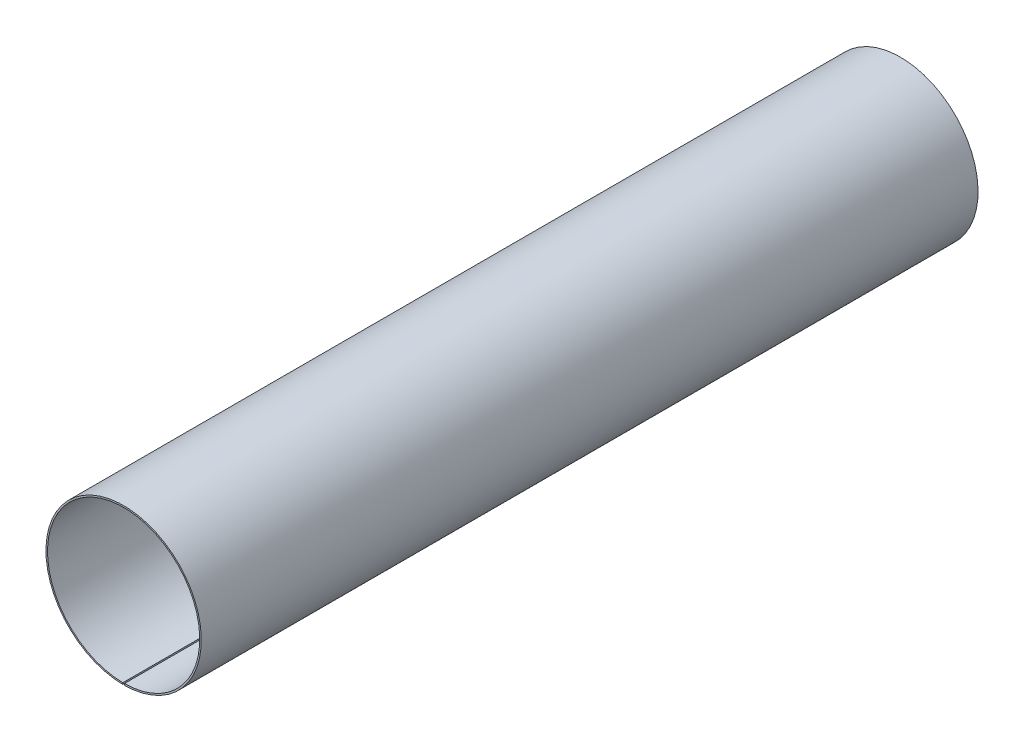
ISO-10303-21;
HEADER;
FILE_DESCRIPTION(('STEP AP214'),'2;1');
FILE_NAME('part.step','',(''),(''),'','','');
FILE_SCHEMA(('AUTOMOTIVE_DESIGN { 1 0 10303 214 1 1 1 1 }'));
ENDSEC;
DATA;
#1=APPLICATION_CONTEXT('core data for automotive mechanical design processes');
#2=APPLICATION_PROTOCOL_DEFINITION('international standard','automotive_design',2000,#1);
#3=PRODUCT_CONTEXT('',#1,'mechanical');
#4=PRODUCT('Part','Part','',(#3));
#5=PRODUCT_RELATED_PRODUCT_CATEGORY('part','',(#4));
#6=PRODUCT_DEFINITION_FORMATION('','',#4);
#7=PRODUCT_DEFINITION_CONTEXT('part definition',#1,'design');
#8=PRODUCT_DEFINITION('design','',#6,#7);
#9=PRODUCT_DEFINITION_SHAPE('','',#8);
#10=(LENGTH_UNIT() NAMED_UNIT(*) SI_UNIT(.MILLI.,.METRE.));
#11=(NAMED_UNIT(*) PLANE_ANGLE_UNIT() SI_UNIT($,.RADIAN.));
#12=(NAMED_UNIT(*) SI_UNIT($,.STERADIAN.) SOLID_ANGLE_UNIT());
#13=UNCERTAINTY_MEASURE_WITH_UNIT(LENGTH_MEASURE(1.E-05),#10,'distance_accuracy_value','');
#14=(GEOMETRIC_REPRESENTATION_CONTEXT(3) GLOBAL_UNCERTAINTY_ASSIGNED_CONTEXT((#13)) GLOBAL_UNIT_ASSIGNED_CONTEXT((#10,
#11,#12)) REPRESENTATION_CONTEXT('',''));
#15=CARTESIAN_POINT('',(0.,0.,0.));
#16=DIRECTION('',(0.,0.,1.));
#17=DIRECTION('',(1.,0.,0.));
#18=AXIS2_PLACEMENT_3D('',#15,#16,#17);
#19=CARTESIAN_POINT('',(0.490000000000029,-48.9975499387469,250.));
#20=DIRECTION('',(0.999949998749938,0.0100000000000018,0.));
#21=DIRECTION('',(0.,0.,1.));
#22=AXIS2_PLACEMENT_3D('',#19,#20,#21);
#23=PLANE('',#22);
#24=DIRECTION('',(0.0100000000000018,-0.999949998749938,0.));
#25=VECTOR('',#24,1.);
#26=CARTESIAN_POINT('',(0.49000000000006,-48.9975499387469,500.));
#27=LINE('',#26,#25);
#28=CARTESIAN_POINT('',(0.49000000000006,-48.9975499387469,500.));
#29=VERTEX_POINT('',#28);
#30=CARTESIAN_POINT('',(0.500000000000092,-49.9974999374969,500.));
#31=VERTEX_POINT('',#30);
#32=EDGE_CURVE('E12',#29,#31,#27,.T.);
#33=ORIENTED_EDGE('',*,*,#32,.F.);
#34=DIRECTION('',(0.,0.,1.));
#35=VECTOR('',#34,1.);
#36=CARTESIAN_POINT('',(0.489999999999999,-48.9975499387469,0.));
#37=LINE('',#36,#35);
#38=CARTESIAN_POINT('',(0.490000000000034,-48.9975499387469,0.));
#39=VERTEX_POINT('',#38);
#40=EDGE_CURVE('E85',#39,#29,#37,.T.);
#41=ORIENTED_EDGE('',*,*,#40,.F.);
#42=DIRECTION('',(0.0100000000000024,-0.999949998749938,0.));
#43=VECTOR('',#42,1.);
#44=CARTESIAN_POINT('',(0.490000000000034,-48.9975499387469,0.));
#45=LINE('',#44,#43);
#46=CARTESIAN_POINT('',(0.500000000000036,-49.9974999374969,0.));
#47=VERTEX_POINT('',#46);
#48=EDGE_CURVE('E47',#39,#47,#45,.T.);
#49=ORIENTED_EDGE('',*,*,#48,.T.);
#50=DIRECTION('',(0.,0.,-1.));
#51=VECTOR('',#50,1.);
#52=CARTESIAN_POINT('',(0.500000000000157,-49.9974999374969,1086.68430109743));
#53=LINE('',#52,#51);
#54=EDGE_CURVE('E84',#47,#31,#53,.F.);
#55=ORIENTED_EDGE('',*,*,#54,.T.);
#56=EDGE_LOOP('',(#33,#41,#49,#55));
#57=FACE_BOUND('',#56,.T.);
#58=ADVANCED_FACE('F37',(#57),#23,.F.);
#59=CARTESIAN_POINT('',(0.,0.,0.));
#60=DIRECTION('',(0.,0.,1.));
#61=DIRECTION('',(1.,0.,0.));
#62=AXIS2_PLACEMENT_3D('',#59,#60,#61);
#63=PLANE('',#62);
#64=ORIENTED_EDGE('',*,*,#48,.F.);
#65=CARTESIAN_POINT('',(0.,0.,0.));
#66=DIRECTION('',(0.,0.,-1.));
#67=DIRECTION('',(-1.,0.,0.));
#68=AXIS2_PLACEMENT_3D('',#65,#66,#67);
#69=CIRCLE('',#68,49.);
#70=CARTESIAN_POINT('',(-0.489999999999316,-48.9975499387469,0.));
#71=VERTEX_POINT('',#70);
#72=EDGE_CURVE('E105',#71,#39,#69,.T.);
#73=ORIENTED_EDGE('',*,*,#72,.F.);
#74=DIRECTION('',(-0.00999999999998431,-0.999949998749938,0.));
#75=VECTOR('',#74,1.);
#76=CARTESIAN_POINT('',(-0.489999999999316,-48.9975499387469,0.));
#77=LINE('',#76,#75);
#78=CARTESIAN_POINT('',(-0.499999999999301,-49.9974999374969,0.));
#79=VERTEX_POINT('',#78);
#80=EDGE_CURVE('E80',#71,#79,#77,.T.);
#81=ORIENTED_EDGE('',*,*,#80,.T.);
#82=CARTESIAN_POINT('',(0.,0.,0.));
#83=DIRECTION('',(0.,0.,-1.));
#84=DIRECTION('',(-1.,0.,0.));
#85=AXIS2_PLACEMENT_3D('',#82,#83,#84);
#86=CIRCLE('',#85,50.);
#87=EDGE_CURVE('E92',#79,#47,#86,.T.);
#88=ORIENTED_EDGE('',*,*,#87,.T.);
#89=EDGE_LOOP('',(#64,#73,#81,#88));
#90=FACE_BOUND('',#89,.T.);
#91=ADVANCED_FACE('F95',(#90),#63,.F.);
#92=CARTESIAN_POINT('',(-0.489999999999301,-48.9975499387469,250.));
#93=DIRECTION('',(-0.999949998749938,0.00999999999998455,0.));
#94=DIRECTION('',(0.,0.,-1.));
#95=AXIS2_PLACEMENT_3D('',#92,#93,#94);
#96=PLANE('',#95);
#97=ORIENTED_EDGE('',*,*,#80,.F.);
#98=DIRECTION('',(0.,0.,-1.));
#99=VECTOR('',#98,1.);
#100=CARTESIAN_POINT('',(-0.489999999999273,-48.9975499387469,500.));
#101=LINE('',#100,#99);
#102=CARTESIAN_POINT('',(-0.489999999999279,-48.9975499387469,500.));
#103=VERTEX_POINT('',#102);
#104=EDGE_CURVE('E96',#103,#71,#101,.T.);
#105=ORIENTED_EDGE('',*,*,#104,.F.);
#106=DIRECTION('',(-0.00999999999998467,-0.999949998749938,0.));
#107=VECTOR('',#106,1.);
#108=CARTESIAN_POINT('',(-0.489999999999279,-48.9975499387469,500.));
#109=LINE('',#108,#107);
#110=CARTESIAN_POINT('',(-0.499999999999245,-49.9974999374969,500.));
#111=VERTEX_POINT('',#110);
#112=EDGE_CURVE('E41',#103,#111,#109,.T.);
#113=ORIENTED_EDGE('',*,*,#112,.T.);
#114=DIRECTION('',(0.,0.,-1.));
#115=VECTOR('',#114,1.);
#116=CARTESIAN_POINT('',(-0.49999999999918,-49.9974999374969,1086.68430109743));
#117=LINE('',#116,#115);
#118=EDGE_CURVE('E102',#111,#79,#117,.T.);
#119=ORIENTED_EDGE('',*,*,#118,.T.);
#120=EDGE_LOOP('',(#97,#105,#113,#119));
#121=FACE_BOUND('',#120,.T.);
#122=ADVANCED_FACE('F109',(#121),#96,.F.);
#123=CARTESIAN_POINT('',(0.,0.,500.));
#124=DIRECTION('',(0.,0.,-1.));
#125=DIRECTION('',(-1.,0.,0.));
#126=AXIS2_PLACEMENT_3D('',#123,#124,#125);
#127=PLANE('',#126);
#128=CARTESIAN_POINT('',(0.,0.,500.));
#129=DIRECTION('',(0.,0.,1.));
#130=DIRECTION('',(1.,0.,0.));
#131=AXIS2_PLACEMENT_3D('',#128,#129,#130);
#132=CIRCLE('',#131,49.);
#133=EDGE_CURVE('E99',#29,#103,#132,.T.);
#134=ORIENTED_EDGE('',*,*,#133,.F.);
#135=ORIENTED_EDGE('',*,*,#32,.T.);
#136=CARTESIAN_POINT('',(0.,0.,500.));
#137=DIRECTION('',(0.,0.,-1.));
#138=DIRECTION('',(-1.,0.,0.));
#139=AXIS2_PLACEMENT_3D('',#136,#137,#138);
#140=CIRCLE('',#139,50.);
#141=EDGE_CURVE('E93',#31,#111,#140,.F.);
#142=ORIENTED_EDGE('',*,*,#141,.T.);
#143=ORIENTED_EDGE('',*,*,#112,.F.);
#144=EDGE_LOOP('',(#134,#135,#142,#143));
#145=FACE_BOUND('',#144,.T.);
#146=ADVANCED_FACE('F39',(#145),#127,.F.);
#147=CARTESIAN_POINT('',(0.,0.,1086.68430109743));
#148=DIRECTION('',(0.,0.,-1.));
#149=DIRECTION('',(-1.,0.,0.));
#150=AXIS2_PLACEMENT_3D('',#147,#148,#149);
#151=CYLINDRICAL_SURFACE('',#150,50.);
#152=ORIENTED_EDGE('',*,*,#118,.F.);
#153=ORIENTED_EDGE('',*,*,#141,.F.);
#154=ORIENTED_EDGE('',*,*,#54,.F.);
#155=ORIENTED_EDGE('',*,*,#87,.F.);
#156=EDGE_LOOP('',(#152,#153,#154,#155));
#157=FACE_BOUND('',#156,.T.);
#158=ADVANCED_FACE('F91',(#157),#151,.T.);
#159=CARTESIAN_POINT('',(0.,0.,1086.68430109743));
#160=DIRECTION('',(0.,0.,-1.));
#161=DIRECTION('',(-1.,0.,0.));
#162=AXIS2_PLACEMENT_3D('',#159,#160,#161);
#163=CYLINDRICAL_SURFACE('',#162,49.);
#164=ORIENTED_EDGE('',*,*,#104,.T.);
#165=ORIENTED_EDGE('',*,*,#72,.T.);
#166=ORIENTED_EDGE('',*,*,#40,.T.);
#167=ORIENTED_EDGE('',*,*,#133,.T.);
#168=EDGE_LOOP('',(#164,#165,#166,#167));
#169=FACE_BOUND('',#168,.T.);
#170=ADVANCED_FACE('F111',(#169),#163,.F.);
#171=CLOSED_SHELL('',(#58,#91,#122,#146,#158,#170));
#172=MANIFOLD_SOLID_BREP('B2',#171);
#173=ADVANCED_BREP_SHAPE_REPRESENTATION('',(#18,#172),#14);
#174=SHAPE_DEFINITION_REPRESENTATION(#9,#173);
ENDSEC;
END-ISO-10303-21;
